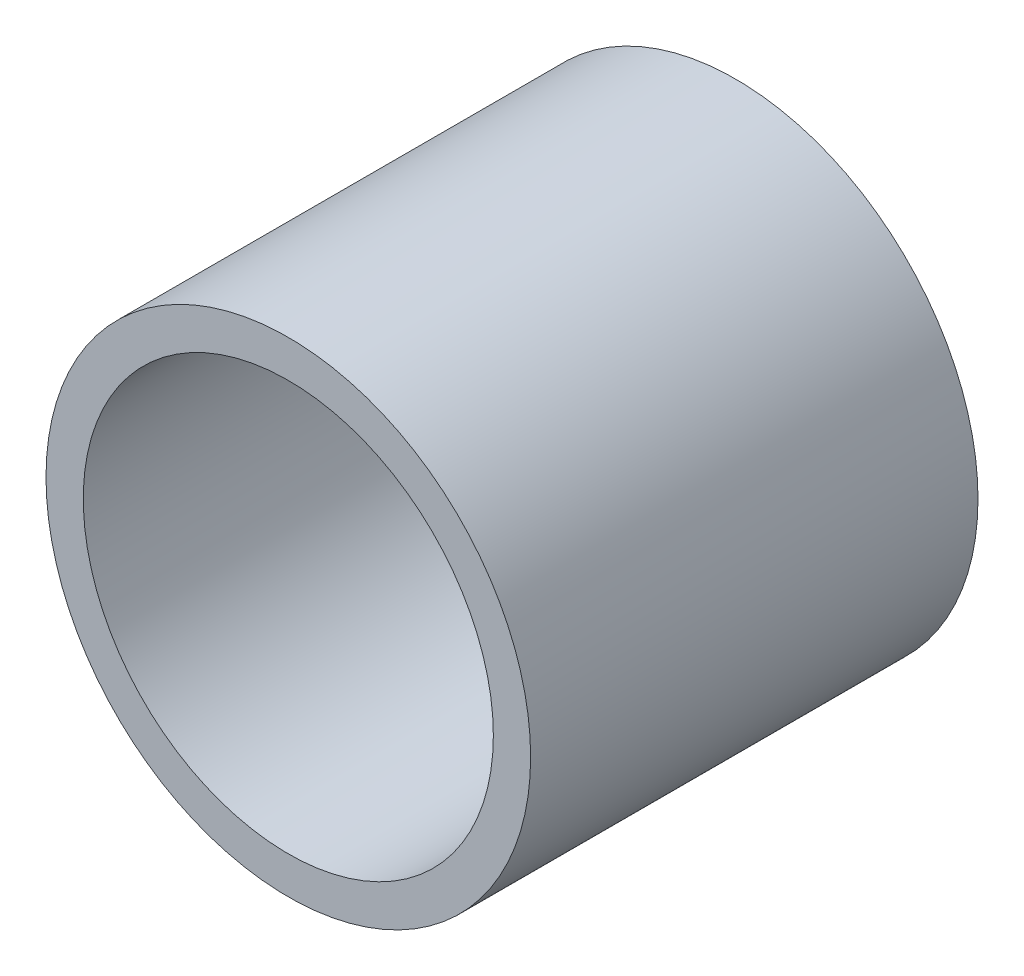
from build123d import *

# Parameters (mm, degrees)
ESQUISSE1_R      = 13
ESQUISSE1_R_2    = 11
EXTRUSION1_DEPTH = 24
CHANFREIN1_SIZE  = 1


with BuildPart() as part:
    # Esquisse1 → Extrusion1 (new body)
    with BuildSketch(Plane.XY):
        Circle(ESQUISSE1_R)
        Circle(ESQUISSE1_R_2, mode=Mode.SUBTRACT)
    extrude(amount=EXTRUSION1_DEPTH)

    # Chanfrein1
    chanfrein1_edges = [part.edges().sort_by_distance(p)[0] for p in [
        (-11, 0, 0),
    ]]
    chamfer(chanfrein1_edges, length=CHANFREIN1_SIZE)


solid = part.part
